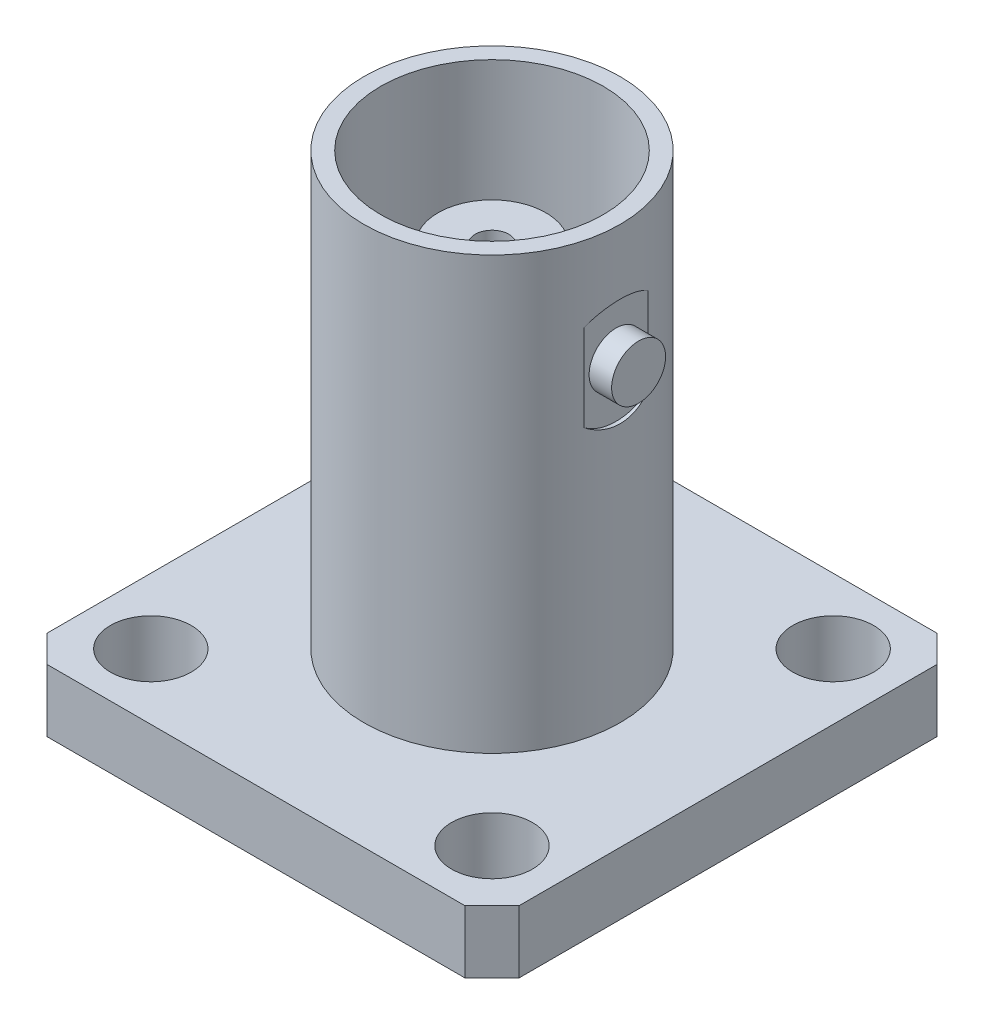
ISO-10303-21;
HEADER;
FILE_DESCRIPTION(('STEP AP214'),'2;1');
FILE_NAME('part.step','',(''),(''),'','','');
FILE_SCHEMA(('AUTOMOTIVE_DESIGN { 1 0 10303 214 1 1 1 1 }'));
ENDSEC;
DATA;
#1=APPLICATION_CONTEXT('core data for automotive mechanical design processes');
#2=APPLICATION_PROTOCOL_DEFINITION('international standard','automotive_design',2000,#1);
#3=PRODUCT_CONTEXT('',#1,'mechanical');
#4=PRODUCT('Part','Part','',(#3));
#5=PRODUCT_RELATED_PRODUCT_CATEGORY('part','',(#4));
#6=PRODUCT_DEFINITION_FORMATION('','',#4);
#7=PRODUCT_DEFINITION_CONTEXT('part definition',#1,'design');
#8=PRODUCT_DEFINITION('design','',#6,#7);
#9=PRODUCT_DEFINITION_SHAPE('','',#8);
#10=(LENGTH_UNIT() NAMED_UNIT(*) SI_UNIT(.MILLI.,.METRE.));
#11=(NAMED_UNIT(*) PLANE_ANGLE_UNIT() SI_UNIT($,.RADIAN.));
#12=(NAMED_UNIT(*) SI_UNIT($,.STERADIAN.) SOLID_ANGLE_UNIT());
#13=UNCERTAINTY_MEASURE_WITH_UNIT(LENGTH_MEASURE(1.E-05),#10,'distance_accuracy_value','');
#14=(GEOMETRIC_REPRESENTATION_CONTEXT(3) GLOBAL_UNCERTAINTY_ASSIGNED_CONTEXT((#13)) GLOBAL_UNIT_ASSIGNED_CONTEXT((#10,
#11,#12)) REPRESENTATION_CONTEXT('',''));
#15=CARTESIAN_POINT('',(0.,0.,0.));
#16=DIRECTION('',(0.,0.,1.));
#17=DIRECTION('',(1.,0.,0.));
#18=AXIS2_PLACEMENT_3D('',#15,#16,#17);
#19=CARTESIAN_POINT('',(0.,18.32,0.));
#20=DIRECTION('',(0.,-1.,0.));
#21=DIRECTION('',(0.,0.,-1.));
#22=AXIS2_PLACEMENT_3D('',#19,#20,#21);
#23=CYLINDRICAL_SURFACE('',#22,4.75);
#24=DIRECTION('',(0.,-1.,0.));
#25=VECTOR('',#24,1.);
#26=CARTESIAN_POINT('',(4.6,18.32,1.1842719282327));
#27=LINE('',#26,#25);
#28=CARTESIAN_POINT('',(4.6,15.5316761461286,1.1842719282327));
#29=VERTEX_POINT('',#28);
#30=CARTESIAN_POINT('',(4.6,12.3083238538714,1.1842719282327));
#31=VERTEX_POINT('',#30);
#32=EDGE_CURVE('E131',#29,#31,#27,.T.);
#33=ORIENTED_EDGE('',*,*,#32,.F.);
#34=CARTESIAN_POINT('',(4.6,15.5316761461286,1.1842719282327));
#35=CARTESIAN_POINT('',(4.61113315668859,15.5634460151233,1.14103185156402));
#36=CARTESIAN_POINT('',(4.621951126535,15.5935051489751,1.09647967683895));
#37=CARTESIAN_POINT('',(4.64271535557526,15.6500290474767,1.00493769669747));
#38=CARTESIAN_POINT('',(4.65266132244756,15.6764926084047,0.957947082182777));
#39=CARTESIAN_POINT('',(4.68084373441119,15.7502675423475,0.813510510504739));
#40=CARTESIAN_POINT('',(4.6973928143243,15.7918750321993,0.712719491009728));
#41=CARTESIAN_POINT('',(4.72427672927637,15.8583555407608,0.504713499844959));
#42=CARTESIAN_POINT('',(4.7345963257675,15.8831875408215,0.397483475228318));
#43=CARTESIAN_POINT('',(4.74782814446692,15.9148894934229,0.180120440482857));
#44=CARTESIAN_POINT('',(4.7507543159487,15.9217932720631,0.0699932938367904));
#45=CARTESIAN_POINT('',(4.74895227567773,15.9175098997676,-0.144815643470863));
#46=CARTESIAN_POINT('',(4.74456563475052,15.9071300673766,-0.249517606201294));
#47=CARTESIAN_POINT('',(4.72922471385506,15.8702172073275,-0.455674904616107));
#48=CARTESIAN_POINT('',(4.71826058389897,15.8436599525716,-0.557125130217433));
#49=CARTESIAN_POINT('',(4.69128557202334,15.776493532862,-0.750717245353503));
#50=CARTESIAN_POINT('',(4.67545424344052,15.7363799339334,-0.843056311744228));
#51=CARTESIAN_POINT('',(4.64893202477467,15.6665757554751,-0.975690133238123));
#52=CARTESIAN_POINT('',(4.63963738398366,15.6417260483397,-1.01888970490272));
#53=CARTESIAN_POINT('',(4.62031799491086,15.5889632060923,-1.10319096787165));
#54=CARTESIAN_POINT('',(4.6102934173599,15.5610507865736,-1.14429314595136));
#55=CARTESIAN_POINT('',(4.6,15.5316761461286,-1.1842719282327));
#56=B_SPLINE_CURVE_WITH_KNOTS('',3,(#34,#35,#36,#37,#38,#39,#40,#41,#42,#43,#44,#45,#46,#47,#48,
#49,#50,#51,#52,#53,#54,#55),.UNSPECIFIED.,.F.,.F.,(4,2,2,2,2,2,2,2,2,2,4),(0.,
0.164310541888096,0.328675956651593,0.657857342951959,0.987840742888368,1.31720109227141,
1.6316043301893,1.94647957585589,2.25090553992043,2.40287289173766,2.55480481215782),.UNSPECIFIED.);
#57=CARTESIAN_POINT('',(4.6,15.5316761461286,-1.1842719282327));
#58=VERTEX_POINT('',#57);
#59=EDGE_CURVE('E189',#29,#58,#56,.T.);
#60=ORIENTED_EDGE('',*,*,#59,.T.);
#61=DIRECTION('',(0.,-1.,0.));
#62=VECTOR('',#61,1.);
#63=CARTESIAN_POINT('',(4.6,18.32,-1.1842719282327));
#64=LINE('',#63,#62);
#65=CARTESIAN_POINT('',(4.6,12.3083238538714,-1.1842719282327));
#66=VERTEX_POINT('',#65);
#67=EDGE_CURVE('E196',#66,#58,#64,.F.);
#68=ORIENTED_EDGE('',*,*,#67,.F.);
#69=CARTESIAN_POINT('',(4.6,12.3083238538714,-1.1842719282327));
#70=CARTESIAN_POINT('',(4.61113315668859,12.2765539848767,-1.14103185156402));
#71=CARTESIAN_POINT('',(4.621951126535,12.2464948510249,-1.09647967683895));
#72=CARTESIAN_POINT('',(4.64271535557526,12.1899709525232,-1.00493769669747));
#73=CARTESIAN_POINT('',(4.65266132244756,12.1635073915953,-0.957947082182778));
#74=CARTESIAN_POINT('',(4.68084373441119,12.0897324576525,-0.81351051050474));
#75=CARTESIAN_POINT('',(4.6973928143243,12.0481249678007,-0.712719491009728));
#76=CARTESIAN_POINT('',(4.72427672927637,11.9816444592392,-0.504713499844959));
#77=CARTESIAN_POINT('',(4.7345963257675,11.9568124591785,-0.397483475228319));
#78=CARTESIAN_POINT('',(4.74782814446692,11.9251105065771,-0.180120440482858));
#79=CARTESIAN_POINT('',(4.7507543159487,11.9182067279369,-0.0699932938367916));
#80=CARTESIAN_POINT('',(4.74895227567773,11.9224901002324,0.144815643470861));
#81=CARTESIAN_POINT('',(4.74456563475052,11.9328699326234,0.249517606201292));
#82=CARTESIAN_POINT('',(4.72922471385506,11.9697827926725,0.455674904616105));
#83=CARTESIAN_POINT('',(4.71826058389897,11.9963400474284,0.557125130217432));
#84=CARTESIAN_POINT('',(4.69128557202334,12.063506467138,0.750717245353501));
#85=CARTESIAN_POINT('',(4.67545424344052,12.1036200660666,0.843056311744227));
#86=CARTESIAN_POINT('',(4.64893202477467,12.1734242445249,0.975690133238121));
#87=CARTESIAN_POINT('',(4.63963738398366,12.1982739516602,1.01888970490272));
#88=CARTESIAN_POINT('',(4.62031799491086,12.2510367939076,1.10319096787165));
#89=CARTESIAN_POINT('',(4.6102934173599,12.2789492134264,1.14429314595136));
#90=CARTESIAN_POINT('',(4.6,12.3083238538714,1.1842719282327));
#91=B_SPLINE_CURVE_WITH_KNOTS('',3,(#69,#70,#71,#72,#73,#74,#75,#76,#77,#78,#79,#80,#81,#82,#83,
#84,#85,#86,#87,#88,#89,#90),.UNSPECIFIED.,.F.,.F.,(4,2,2,2,2,2,2,2,2,2,4),(0.,
0.164310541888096,0.328675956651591,0.657857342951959,0.987840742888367,1.3172010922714,
1.6316043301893,1.94647957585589,2.25090553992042,2.40287289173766,2.55480481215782),.UNSPECIFIED.);
#92=EDGE_CURVE('E54',#66,#31,#91,.T.);
#93=ORIENTED_EDGE('',*,*,#92,.T.);
#94=EDGE_LOOP('',(#33,#60,#68,#93));
#95=FACE_BOUND('',#94,.T.);
#96=CARTESIAN_POINT('',(0.,18.32,0.));
#97=DIRECTION('',(0.,1.,0.));
#98=DIRECTION('',(0.,0.,1.));
#99=AXIS2_PLACEMENT_3D('',#96,#97,#98);
#100=CIRCLE('',#99,4.75);
#101=CARTESIAN_POINT('',(0.,18.32,4.75));
#102=VERTEX_POINT('',#101);
#103=EDGE_CURVE('E298',#102,#102,#100,.T.);
#104=ORIENTED_EDGE('',*,*,#103,.F.);
#105=EDGE_LOOP('',(#104));
#106=FACE_BOUND('',#105,.T.);
#107=CARTESIAN_POINT('',(0.,2.32,0.));
#108=DIRECTION('',(0.,1.,0.));
#109=DIRECTION('',(0.,0.,1.));
#110=AXIS2_PLACEMENT_3D('',#107,#108,#109);
#111=CIRCLE('',#110,4.75);
#112=CARTESIAN_POINT('',(0.,2.32,4.75));
#113=VERTEX_POINT('',#112);
#114=EDGE_CURVE('E301',#113,#113,#111,.T.);
#115=ORIENTED_EDGE('',*,*,#114,.T.);
#116=EDGE_LOOP('',(#115));
#117=FACE_BOUND('',#116,.T.);
#118=CARTESIAN_POINT('',(-4.6,12.3083238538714,-1.1842719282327));
#119=CARTESIAN_POINT('',(-4.61113315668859,12.2765539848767,-1.14103185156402));
#120=CARTESIAN_POINT('',(-4.621951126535,12.2464948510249,-1.09647967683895));
#121=CARTESIAN_POINT('',(-4.64271535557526,12.1899709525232,-1.00493769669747));
#122=CARTESIAN_POINT('',(-4.65266132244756,12.1635073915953,-0.957947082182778));
#123=CARTESIAN_POINT('',(-4.68084373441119,12.0897324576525,-0.81351051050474));
#124=CARTESIAN_POINT('',(-4.6973928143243,12.0481249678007,-0.712719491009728));
#125=CARTESIAN_POINT('',(-4.72427672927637,11.9816444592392,-0.504713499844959));
#126=CARTESIAN_POINT('',(-4.7345963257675,11.9568124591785,-0.397483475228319));
#127=CARTESIAN_POINT('',(-4.74782814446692,11.9251105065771,-0.180120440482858));
#128=CARTESIAN_POINT('',(-4.7507543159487,11.9182067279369,-0.0699932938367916));
#129=CARTESIAN_POINT('',(-4.74895227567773,11.9224901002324,0.144815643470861));
#130=CARTESIAN_POINT('',(-4.74456563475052,11.9328699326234,0.249517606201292));
#131=CARTESIAN_POINT('',(-4.72922471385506,11.9697827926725,0.455674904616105));
#132=CARTESIAN_POINT('',(-4.71826058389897,11.9963400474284,0.557125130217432));
#133=CARTESIAN_POINT('',(-4.69128557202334,12.063506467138,0.750717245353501));
#134=CARTESIAN_POINT('',(-4.67545424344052,12.1036200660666,0.843056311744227));
#135=CARTESIAN_POINT('',(-4.64893202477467,12.1734242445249,0.975690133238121));
#136=CARTESIAN_POINT('',(-4.63963738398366,12.1982739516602,1.01888970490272));
#137=CARTESIAN_POINT('',(-4.62031799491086,12.2510367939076,1.10319096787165));
#138=CARTESIAN_POINT('',(-4.6102934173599,12.2789492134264,1.14429314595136));
#139=CARTESIAN_POINT('',(-4.6,12.3083238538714,1.1842719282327));
#140=B_SPLINE_CURVE_WITH_KNOTS('',3,(#118,#119,#120,#121,#122,#123,#124,#125,#126,#127,#128,
#129,#130,#131,#132,#133,#134,#135,#136,#137,#138,#139),.UNSPECIFIED.,.F.,.F.,(4,2,2,2,2,2,2,2,
2,2,4),(0.,0.164310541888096,0.328675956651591,0.657857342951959,0.987840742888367,
1.3172010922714,1.6316043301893,1.94647957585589,2.25090553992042,2.40287289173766,
2.55480481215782),.UNSPECIFIED.);
#141=CARTESIAN_POINT('',(-4.6,12.3083238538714,-1.1842719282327));
#142=VERTEX_POINT('',#141);
#143=CARTESIAN_POINT('',(-4.6,12.3083238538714,1.1842719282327));
#144=VERTEX_POINT('',#143);
#145=EDGE_CURVE('E130',#142,#144,#140,.T.);
#146=ORIENTED_EDGE('',*,*,#145,.F.);
#147=DIRECTION('',(0.,-1.,0.));
#148=VECTOR('',#147,1.);
#149=CARTESIAN_POINT('',(-4.6,18.32,-1.1842719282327));
#150=LINE('',#149,#148);
#151=CARTESIAN_POINT('',(-4.6,15.5316761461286,-1.1842719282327));
#152=VERTEX_POINT('',#151);
#153=EDGE_CURVE('E40',#152,#142,#150,.T.);
#154=ORIENTED_EDGE('',*,*,#153,.F.);
#155=CARTESIAN_POINT('',(-4.6,15.5316761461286,1.1842719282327));
#156=CARTESIAN_POINT('',(-4.61113315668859,15.5634460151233,1.14103185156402));
#157=CARTESIAN_POINT('',(-4.621951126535,15.5935051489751,1.09647967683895));
#158=CARTESIAN_POINT('',(-4.64271535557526,15.6500290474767,1.00493769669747));
#159=CARTESIAN_POINT('',(-4.65266132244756,15.6764926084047,0.957947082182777));
#160=CARTESIAN_POINT('',(-4.68084373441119,15.7502675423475,0.813510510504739));
#161=CARTESIAN_POINT('',(-4.6973928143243,15.7918750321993,0.712719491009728));
#162=CARTESIAN_POINT('',(-4.72427672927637,15.8583555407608,0.504713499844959));
#163=CARTESIAN_POINT('',(-4.7345963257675,15.8831875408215,0.397483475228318));
#164=CARTESIAN_POINT('',(-4.74782814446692,15.9148894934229,0.180120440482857));
#165=CARTESIAN_POINT('',(-4.7507543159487,15.9217932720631,0.0699932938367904));
#166=CARTESIAN_POINT('',(-4.74895227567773,15.9175098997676,-0.144815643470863));
#167=CARTESIAN_POINT('',(-4.74456563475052,15.9071300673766,-0.249517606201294));
#168=CARTESIAN_POINT('',(-4.72922471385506,15.8702172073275,-0.455674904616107));
#169=CARTESIAN_POINT('',(-4.71826058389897,15.8436599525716,-0.557125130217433));
#170=CARTESIAN_POINT('',(-4.69128557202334,15.776493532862,-0.750717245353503));
#171=CARTESIAN_POINT('',(-4.67545424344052,15.7363799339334,-0.843056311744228));
#172=CARTESIAN_POINT('',(-4.64893202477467,15.6665757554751,-0.975690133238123));
#173=CARTESIAN_POINT('',(-4.63963738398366,15.6417260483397,-1.01888970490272));
#174=CARTESIAN_POINT('',(-4.62031799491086,15.5889632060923,-1.10319096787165));
#175=CARTESIAN_POINT('',(-4.6102934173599,15.5610507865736,-1.14429314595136));
#176=CARTESIAN_POINT('',(-4.6,15.5316761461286,-1.1842719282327));
#177=B_SPLINE_CURVE_WITH_KNOTS('',3,(#155,#156,#157,#158,#159,#160,#161,#162,#163,#164,#165,
#166,#167,#168,#169,#170,#171,#172,#173,#174,#175,#176),.UNSPECIFIED.,.F.,.F.,(4,2,2,2,2,2,2,2,
2,2,4),(0.,0.164310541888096,0.328675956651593,0.657857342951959,0.987840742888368,
1.31720109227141,1.6316043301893,1.94647957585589,2.25090553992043,2.40287289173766,
2.55480481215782),.UNSPECIFIED.);
#178=CARTESIAN_POINT('',(-4.6,15.5316761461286,1.1842719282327));
#179=VERTEX_POINT('',#178);
#180=EDGE_CURVE('E123',#179,#152,#177,.T.);
#181=ORIENTED_EDGE('',*,*,#180,.F.);
#182=DIRECTION('',(0.,-1.,0.));
#183=VECTOR('',#182,1.);
#184=CARTESIAN_POINT('',(-4.6,18.32,1.1842719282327));
#185=LINE('',#184,#183);
#186=EDGE_CURVE('E134',#144,#179,#185,.F.);
#187=ORIENTED_EDGE('',*,*,#186,.F.);
#188=EDGE_LOOP('',(#146,#154,#181,#187));
#189=FACE_BOUND('',#188,.T.);
#190=ADVANCED_FACE('F32',(#95,#106,#117,#189),#23,.T.);
#191=CARTESIAN_POINT('',(8.75,2.32,-8.75));
#192=DIRECTION('',(-1.,0.,0.));
#193=DIRECTION('',(0.,0.,1.));
#194=AXIS2_PLACEMENT_3D('',#191,#192,#193);
#195=PLANE('',#194);
#196=DIRECTION('',(0.,0.,-1.));
#197=VECTOR('',#196,1.);
#198=CARTESIAN_POINT('',(8.75,0.,-8.75));
#199=LINE('',#198,#197);
#200=CARTESIAN_POINT('',(8.75,0.,7.74999999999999));
#201=VERTEX_POINT('',#200);
#202=CARTESIAN_POINT('',(8.75,0.,-7.75));
#203=VERTEX_POINT('',#202);
#204=EDGE_CURVE('E263',#201,#203,#199,.T.);
#205=ORIENTED_EDGE('',*,*,#204,.T.);
#206=DIRECTION('',(0.,1.,0.));
#207=VECTOR('',#206,1.);
#208=CARTESIAN_POINT('',(8.75,2.32,-7.75));
#209=LINE('',#208,#207);
#210=CARTESIAN_POINT('',(8.75,2.32,-7.75));
#211=VERTEX_POINT('',#210);
#212=EDGE_CURVE('E221',#203,#211,#209,.T.);
#213=ORIENTED_EDGE('',*,*,#212,.T.);
#214=DIRECTION('',(0.,0.,-1.));
#215=VECTOR('',#214,1.);
#216=CARTESIAN_POINT('',(8.75,2.32,-8.75));
#217=LINE('',#216,#215);
#218=CARTESIAN_POINT('',(8.75,2.32,7.74999999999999));
#219=VERTEX_POINT('',#218);
#220=EDGE_CURVE('E256',#219,#211,#217,.T.);
#221=ORIENTED_EDGE('',*,*,#220,.F.);
#222=DIRECTION('',(0.,-1.,0.));
#223=VECTOR('',#222,1.);
#224=CARTESIAN_POINT('',(8.75,2.32,7.74999999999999));
#225=LINE('',#224,#223);
#226=EDGE_CURVE('E223',#219,#201,#225,.T.);
#227=ORIENTED_EDGE('',*,*,#226,.T.);
#228=EDGE_LOOP('',(#205,#213,#221,#227));
#229=FACE_BOUND('',#228,.T.);
#230=ADVANCED_FACE('F348',(#229),#195,.F.);
#231=CARTESIAN_POINT('',(-8.75,2.32,-8.75));
#232=DIRECTION('',(0.,0.,1.));
#233=DIRECTION('',(1.,0.,0.));
#234=AXIS2_PLACEMENT_3D('',#231,#232,#233);
#235=PLANE('',#234);
#236=DIRECTION('',(-1.,0.,0.));
#237=VECTOR('',#236,1.);
#238=CARTESIAN_POINT('',(-8.75,0.,-8.75));
#239=LINE('',#238,#237);
#240=CARTESIAN_POINT('',(7.75000000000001,0.,-8.75));
#241=VERTEX_POINT('',#240);
#242=CARTESIAN_POINT('',(-7.75,0.,-8.75));
#243=VERTEX_POINT('',#242);
#244=EDGE_CURVE('E260',#241,#243,#239,.T.);
#245=ORIENTED_EDGE('',*,*,#244,.T.);
#246=DIRECTION('',(0.,1.,0.));
#247=VECTOR('',#246,1.);
#248=CARTESIAN_POINT('',(-7.75,2.32,-8.75));
#249=LINE('',#248,#247);
#250=CARTESIAN_POINT('',(-7.75,2.32,-8.75));
#251=VERTEX_POINT('',#250);
#252=EDGE_CURVE('E234',#243,#251,#249,.T.);
#253=ORIENTED_EDGE('',*,*,#252,.T.);
#254=DIRECTION('',(-1.,0.,0.));
#255=VECTOR('',#254,1.);
#256=CARTESIAN_POINT('',(-8.75,2.32,-8.75));
#257=LINE('',#256,#255);
#258=CARTESIAN_POINT('',(7.75000000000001,2.32,-8.75));
#259=VERTEX_POINT('',#258);
#260=EDGE_CURVE('E272',#259,#251,#257,.T.);
#261=ORIENTED_EDGE('',*,*,#260,.F.);
#262=DIRECTION('',(0.,-1.,0.));
#263=VECTOR('',#262,1.);
#264=CARTESIAN_POINT('',(7.75000000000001,2.32,-8.75));
#265=LINE('',#264,#263);
#266=EDGE_CURVE('E236',#259,#241,#265,.T.);
#267=ORIENTED_EDGE('',*,*,#266,.T.);
#268=EDGE_LOOP('',(#245,#253,#261,#267));
#269=FACE_BOUND('',#268,.T.);
#270=ADVANCED_FACE('F352',(#269),#235,.F.);
#271=CARTESIAN_POINT('',(-8.75,2.32,-8.75));
#272=DIRECTION('',(1.,0.,0.));
#273=DIRECTION('',(0.,0.,-1.));
#274=AXIS2_PLACEMENT_3D('',#271,#272,#273);
#275=PLANE('',#274);
#276=DIRECTION('',(0.,0.,1.));
#277=VECTOR('',#276,1.);
#278=CARTESIAN_POINT('',(-8.75,2.32,-8.75));
#279=LINE('',#278,#277);
#280=CARTESIAN_POINT('',(-8.75,2.32,-7.75000000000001));
#281=VERTEX_POINT('',#280);
#282=CARTESIAN_POINT('',(-8.75,2.32,7.75));
#283=VERTEX_POINT('',#282);
#284=EDGE_CURVE('E269',#281,#283,#279,.T.);
#285=ORIENTED_EDGE('',*,*,#284,.F.);
#286=DIRECTION('',(0.,-1.,0.));
#287=VECTOR('',#286,1.);
#288=CARTESIAN_POINT('',(-8.75,2.32,-7.75000000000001));
#289=LINE('',#288,#287);
#290=CARTESIAN_POINT('',(-8.75,0.,-7.75000000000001));
#291=VERTEX_POINT('',#290);
#292=EDGE_CURVE('E247',#281,#291,#289,.T.);
#293=ORIENTED_EDGE('',*,*,#292,.T.);
#294=DIRECTION('',(0.,0.,1.));
#295=VECTOR('',#294,1.);
#296=CARTESIAN_POINT('',(-8.75,0.,-8.75));
#297=LINE('',#296,#295);
#298=CARTESIAN_POINT('',(-8.75,0.,7.75));
#299=VERTEX_POINT('',#298);
#300=EDGE_CURVE('E257',#291,#299,#297,.T.);
#301=ORIENTED_EDGE('',*,*,#300,.T.);
#302=DIRECTION('',(0.,1.,0.));
#303=VECTOR('',#302,1.);
#304=CARTESIAN_POINT('',(-8.75,2.32,7.75));
#305=LINE('',#304,#303);
#306=EDGE_CURVE('E250',#299,#283,#305,.T.);
#307=ORIENTED_EDGE('',*,*,#306,.T.);
#308=EDGE_LOOP('',(#285,#293,#301,#307));
#309=FACE_BOUND('',#308,.T.);
#310=ADVANCED_FACE('F358',(#309),#275,.F.);
#311=CARTESIAN_POINT('',(-8.75,2.32,8.75));
#312=DIRECTION('',(0.,0.,-1.));
#313=DIRECTION('',(-1.,0.,0.));
#314=AXIS2_PLACEMENT_3D('',#311,#312,#313);
#315=PLANE('',#314);
#316=DIRECTION('',(1.,0.,0.));
#317=VECTOR('',#316,1.);
#318=CARTESIAN_POINT('',(-8.75,0.,8.75));
#319=LINE('',#318,#317);
#320=CARTESIAN_POINT('',(-7.75000000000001,0.,8.75));
#321=VERTEX_POINT('',#320);
#322=CARTESIAN_POINT('',(7.75,0.,8.75));
#323=VERTEX_POINT('',#322);
#324=EDGE_CURVE('E253',#321,#323,#319,.T.);
#325=ORIENTED_EDGE('',*,*,#324,.T.);
#326=DIRECTION('',(0.,1.,0.));
#327=VECTOR('',#326,1.);
#328=CARTESIAN_POINT('',(7.75,2.32,8.75));
#329=LINE('',#328,#327);
#330=CARTESIAN_POINT('',(7.75,2.32,8.75));
#331=VERTEX_POINT('',#330);
#332=EDGE_CURVE('E214',#323,#331,#329,.T.);
#333=ORIENTED_EDGE('',*,*,#332,.T.);
#334=DIRECTION('',(1.,0.,0.));
#335=VECTOR('',#334,1.);
#336=CARTESIAN_POINT('',(-8.75,2.32,8.75));
#337=LINE('',#336,#335);
#338=CARTESIAN_POINT('',(-7.75000000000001,2.32,8.75));
#339=VERTEX_POINT('',#338);
#340=EDGE_CURVE('E252',#339,#331,#337,.T.);
#341=ORIENTED_EDGE('',*,*,#340,.F.);
#342=DIRECTION('',(0.,-1.,0.));
#343=VECTOR('',#342,1.);
#344=CARTESIAN_POINT('',(-7.75000000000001,2.32,8.75));
#345=LINE('',#344,#343);
#346=EDGE_CURVE('E218',#339,#321,#345,.T.);
#347=ORIENTED_EDGE('',*,*,#346,.T.);
#348=EDGE_LOOP('',(#325,#333,#341,#347));
#349=FACE_BOUND('',#348,.T.);
#350=ADVANCED_FACE('F402',(#349),#315,.F.);
#351=CARTESIAN_POINT('',(0.,2.32,0.));
#352=DIRECTION('',(0.,1.,0.));
#353=DIRECTION('',(0.,0.,1.));
#354=AXIS2_PLACEMENT_3D('',#351,#352,#353);
#355=PLANE('',#354);
#356=ORIENTED_EDGE('',*,*,#114,.F.);
#357=EDGE_LOOP('',(#356));
#358=FACE_BOUND('',#357,.T.);
#359=CARTESIAN_POINT('',(-6.325,2.32,6.325));
#360=DIRECTION('',(0.,1.,0.));
#361=DIRECTION('',(0.,0.,-1.));
#362=AXIS2_PLACEMENT_3D('',#359,#360,#361);
#363=CIRCLE('',#362,1.5);
#364=CARTESIAN_POINT('',(-6.325,2.32,4.825));
#365=VERTEX_POINT('',#364);
#366=EDGE_CURVE('E295',#365,#365,#363,.T.);
#367=ORIENTED_EDGE('',*,*,#366,.F.);
#368=EDGE_LOOP('',(#367));
#369=FACE_BOUND('',#368,.T.);
#370=CARTESIAN_POINT('',(-6.325,2.32,-6.325));
#371=DIRECTION('',(0.,-1.,0.));
#372=DIRECTION('',(0.,0.,1.));
#373=AXIS2_PLACEMENT_3D('',#370,#371,#372);
#374=CIRCLE('',#373,1.5);
#375=CARTESIAN_POINT('',(-6.325,2.32,-4.825));
#376=VERTEX_POINT('',#375);
#377=EDGE_CURVE('E289',#376,#376,#374,.T.);
#378=ORIENTED_EDGE('',*,*,#377,.T.);
#379=EDGE_LOOP('',(#378));
#380=FACE_BOUND('',#379,.T.);
#381=CARTESIAN_POINT('',(6.325,2.32,6.325));
#382=DIRECTION('',(0.,-1.,0.));
#383=DIRECTION('',(0.,0.,-1.));
#384=AXIS2_PLACEMENT_3D('',#381,#382,#383);
#385=CIRCLE('',#384,1.5);
#386=CARTESIAN_POINT('',(6.325,2.32,4.825));
#387=VERTEX_POINT('',#386);
#388=EDGE_CURVE('E283',#387,#387,#385,.T.);
#389=ORIENTED_EDGE('',*,*,#388,.T.);
#390=EDGE_LOOP('',(#389));
#391=FACE_BOUND('',#390,.T.);
#392=CARTESIAN_POINT('',(6.325,2.32,-6.325));
#393=DIRECTION('',(0.,1.,0.));
#394=DIRECTION('',(0.,0.,1.));
#395=AXIS2_PLACEMENT_3D('',#392,#393,#394);
#396=CIRCLE('',#395,1.5);
#397=CARTESIAN_POINT('',(6.325,2.32,-4.825));
#398=VERTEX_POINT('',#397);
#399=EDGE_CURVE('E277',#398,#398,#396,.T.);
#400=ORIENTED_EDGE('',*,*,#399,.F.);
#401=EDGE_LOOP('',(#400));
#402=FACE_BOUND('',#401,.T.);
#403=ORIENTED_EDGE('',*,*,#260,.T.);
#404=DIRECTION('',(0.707106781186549,0.,-0.707106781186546));
#405=VECTOR('',#404,1.);
#406=CARTESIAN_POINT('',(-8.24999999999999,2.32,-8.25000000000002));
#407=LINE('',#406,#405);
#408=EDGE_CURVE('E226',#251,#281,#407,.F.);
#409=ORIENTED_EDGE('',*,*,#408,.T.);
#410=ORIENTED_EDGE('',*,*,#284,.T.);
#411=DIRECTION('',(-0.707106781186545,0.,-0.70710678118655));
#412=VECTOR('',#411,1.);
#413=CARTESIAN_POINT('',(-8.25000000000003,2.32,8.24999999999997));
#414=LINE('',#413,#412);
#415=EDGE_CURVE('E232',#283,#339,#414,.F.);
#416=ORIENTED_EDGE('',*,*,#415,.T.);
#417=ORIENTED_EDGE('',*,*,#340,.T.);
#418=DIRECTION('',(-0.707106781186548,0.,0.707106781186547));
#419=VECTOR('',#418,1.);
#420=CARTESIAN_POINT('',(8.24999999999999,2.32,8.25000000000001));
#421=LINE('',#420,#419);
#422=EDGE_CURVE('E230',#331,#219,#421,.F.);
#423=ORIENTED_EDGE('',*,*,#422,.T.);
#424=ORIENTED_EDGE('',*,*,#220,.T.);
#425=DIRECTION('',(0.707106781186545,0.,0.70710678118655));
#426=VECTOR('',#425,1.);
#427=CARTESIAN_POINT('',(8.25000000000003,2.32,-8.24999999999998));
#428=LINE('',#427,#426);
#429=EDGE_CURVE('E228',#211,#259,#428,.F.);
#430=ORIENTED_EDGE('',*,*,#429,.T.);
#431=EDGE_LOOP('',(#403,#409,#410,#416,#417,#423,#424,#430));
#432=FACE_BOUND('',#431,.T.);
#433=ADVANCED_FACE('F384',(#358,#369,#380,#391,#402,#432),#355,.T.);
#434=CARTESIAN_POINT('',(0.,0.,0.));
#435=DIRECTION('',(0.,1.,0.));
#436=DIRECTION('',(0.,0.,1.));
#437=AXIS2_PLACEMENT_3D('',#434,#435,#436);
#438=PLANE('',#437);
#439=CARTESIAN_POINT('',(0.,0.,0.));
#440=DIRECTION('',(0.,1.,0.));
#441=DIRECTION('',(0.,0.,1.));
#442=AXIS2_PLACEMENT_3D('',#439,#440,#441);
#443=CIRCLE('',#442,4.35);
#444=CARTESIAN_POINT('',(0.,0.,4.35));
#445=VERTEX_POINT('',#444);
#446=EDGE_CURVE('E208',#445,#445,#443,.F.);
#447=ORIENTED_EDGE('',*,*,#446,.F.);
#448=EDGE_LOOP('',(#447));
#449=FACE_BOUND('',#448,.T.);
#450=CARTESIAN_POINT('',(-6.325,0.,6.325));
#451=DIRECTION('',(0.,1.,0.));
#452=DIRECTION('',(0.,0.,-1.));
#453=AXIS2_PLACEMENT_3D('',#450,#451,#452);
#454=CIRCLE('',#453,1.5);
#455=CARTESIAN_POINT('',(-6.325,0.,4.825));
#456=VERTEX_POINT('',#455);
#457=EDGE_CURVE('E292',#456,#456,#454,.T.);
#458=ORIENTED_EDGE('',*,*,#457,.T.);
#459=EDGE_LOOP('',(#458));
#460=FACE_BOUND('',#459,.T.);
#461=CARTESIAN_POINT('',(-6.325,0.,-6.325));
#462=DIRECTION('',(0.,-1.,0.));
#463=DIRECTION('',(0.,0.,1.));
#464=AXIS2_PLACEMENT_3D('',#461,#462,#463);
#465=CIRCLE('',#464,1.5);
#466=CARTESIAN_POINT('',(-6.325,0.,-4.825));
#467=VERTEX_POINT('',#466);
#468=EDGE_CURVE('E286',#467,#467,#465,.T.);
#469=ORIENTED_EDGE('',*,*,#468,.F.);
#470=EDGE_LOOP('',(#469));
#471=FACE_BOUND('',#470,.T.);
#472=CARTESIAN_POINT('',(6.325,0.,6.325));
#473=DIRECTION('',(0.,-1.,0.));
#474=DIRECTION('',(0.,0.,-1.));
#475=AXIS2_PLACEMENT_3D('',#472,#473,#474);
#476=CIRCLE('',#475,1.5);
#477=CARTESIAN_POINT('',(6.325,0.,4.825));
#478=VERTEX_POINT('',#477);
#479=EDGE_CURVE('E280',#478,#478,#476,.T.);
#480=ORIENTED_EDGE('',*,*,#479,.F.);
#481=EDGE_LOOP('',(#480));
#482=FACE_BOUND('',#481,.T.);
#483=CARTESIAN_POINT('',(6.325,0.,-6.325));
#484=DIRECTION('',(0.,1.,0.));
#485=DIRECTION('',(0.,0.,1.));
#486=AXIS2_PLACEMENT_3D('',#483,#484,#485);
#487=CIRCLE('',#486,1.5);
#488=CARTESIAN_POINT('',(6.325,0.,-4.825));
#489=VERTEX_POINT('',#488);
#490=EDGE_CURVE('E266',#489,#489,#487,.T.);
#491=ORIENTED_EDGE('',*,*,#490,.T.);
#492=EDGE_LOOP('',(#491));
#493=FACE_BOUND('',#492,.T.);
#494=ORIENTED_EDGE('',*,*,#300,.F.);
#495=DIRECTION('',(-0.707106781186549,0.,0.707106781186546));
#496=VECTOR('',#495,1.);
#497=CARTESIAN_POINT('',(-8.75,0.,-7.75000000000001));
#498=LINE('',#497,#496);
#499=EDGE_CURVE('E239',#291,#243,#498,.F.);
#500=ORIENTED_EDGE('',*,*,#499,.T.);
#501=ORIENTED_EDGE('',*,*,#244,.F.);
#502=DIRECTION('',(-0.707106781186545,0.,-0.70710678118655));
#503=VECTOR('',#502,1.);
#504=CARTESIAN_POINT('',(7.75000000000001,0.,-8.75));
#505=LINE('',#504,#503);
#506=EDGE_CURVE('E241',#241,#203,#505,.F.);
#507=ORIENTED_EDGE('',*,*,#506,.T.);
#508=ORIENTED_EDGE('',*,*,#204,.F.);
#509=DIRECTION('',(0.707106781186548,0.,-0.707106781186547));
#510=VECTOR('',#509,1.);
#511=CARTESIAN_POINT('',(8.75,0.,7.74999999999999));
#512=LINE('',#511,#510);
#513=EDGE_CURVE('E243',#201,#323,#512,.F.);
#514=ORIENTED_EDGE('',*,*,#513,.T.);
#515=ORIENTED_EDGE('',*,*,#324,.F.);
#516=DIRECTION('',(0.707106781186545,0.,0.70710678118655));
#517=VECTOR('',#516,1.);
#518=CARTESIAN_POINT('',(-7.75000000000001,0.,8.75));
#519=LINE('',#518,#517);
#520=EDGE_CURVE('E245',#321,#299,#519,.F.);
#521=ORIENTED_EDGE('',*,*,#520,.T.);
#522=EDGE_LOOP('',(#494,#500,#501,#507,#508,#514,#515,#521));
#523=FACE_BOUND('',#522,.T.);
#524=ADVANCED_FACE('F367',(#449,#460,#471,#482,#493,#523),#438,.F.);
#525=CARTESIAN_POINT('',(-8.75,2.32,-7.75000000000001));
#526=DIRECTION('',(0.707106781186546,0.,0.707106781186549));
#527=DIRECTION('',(0.,-1.,0.));
#528=AXIS2_PLACEMENT_3D('',#525,#526,#527);
#529=PLANE('',#528);
#530=ORIENTED_EDGE('',*,*,#408,.F.);
#531=ORIENTED_EDGE('',*,*,#252,.F.);
#532=ORIENTED_EDGE('',*,*,#499,.F.);
#533=ORIENTED_EDGE('',*,*,#292,.F.);
#534=EDGE_LOOP('',(#530,#531,#532,#533));
#535=FACE_BOUND('',#534,.T.);
#536=ADVANCED_FACE('F363',(#535),#529,.F.);
#537=CARTESIAN_POINT('',(7.75000000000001,2.32,-8.75));
#538=DIRECTION('',(-0.70710678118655,0.,0.707106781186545));
#539=DIRECTION('',(0.,-1.,0.));
#540=AXIS2_PLACEMENT_3D('',#537,#538,#539);
#541=PLANE('',#540);
#542=ORIENTED_EDGE('',*,*,#429,.F.);
#543=ORIENTED_EDGE('',*,*,#212,.F.);
#544=ORIENTED_EDGE('',*,*,#506,.F.);
#545=ORIENTED_EDGE('',*,*,#266,.F.);
#546=EDGE_LOOP('',(#542,#543,#544,#545));
#547=FACE_BOUND('',#546,.T.);
#548=ADVANCED_FACE('F366',(#547),#541,.F.);
#549=CARTESIAN_POINT('',(8.75,2.32,7.74999999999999));
#550=DIRECTION('',(-0.707106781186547,0.,-0.707106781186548));
#551=DIRECTION('',(0.,-1.,0.));
#552=AXIS2_PLACEMENT_3D('',#549,#550,#551);
#553=PLANE('',#552);
#554=ORIENTED_EDGE('',*,*,#422,.F.);
#555=ORIENTED_EDGE('',*,*,#332,.F.);
#556=ORIENTED_EDGE('',*,*,#513,.F.);
#557=ORIENTED_EDGE('',*,*,#226,.F.);
#558=EDGE_LOOP('',(#554,#555,#556,#557));
#559=FACE_BOUND('',#558,.T.);
#560=ADVANCED_FACE('F370',(#559),#553,.F.);
#561=CARTESIAN_POINT('',(-7.75000000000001,2.32,8.75));
#562=DIRECTION('',(0.70710678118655,0.,-0.707106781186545));
#563=DIRECTION('',(0.,-1.,0.));
#564=AXIS2_PLACEMENT_3D('',#561,#562,#563);
#565=PLANE('',#564);
#566=ORIENTED_EDGE('',*,*,#415,.F.);
#567=ORIENTED_EDGE('',*,*,#306,.F.);
#568=ORIENTED_EDGE('',*,*,#520,.F.);
#569=ORIENTED_EDGE('',*,*,#346,.F.);
#570=EDGE_LOOP('',(#566,#567,#568,#569));
#571=FACE_BOUND('',#570,.T.);
#572=ADVANCED_FACE('F34',(#571),#565,.F.);
#573=CARTESIAN_POINT('',(6.325,0.,-6.325));
#574=DIRECTION('',(0.,1.,0.));
#575=DIRECTION('',(0.,0.,1.));
#576=AXIS2_PLACEMENT_3D('',#573,#574,#575);
#577=CYLINDRICAL_SURFACE('',#576,1.5);
#578=ORIENTED_EDGE('',*,*,#490,.F.);
#579=EDGE_LOOP('',(#578));
#580=FACE_BOUND('',#579,.T.);
#581=ORIENTED_EDGE('',*,*,#399,.T.);
#582=EDGE_LOOP('',(#581));
#583=FACE_BOUND('',#582,.T.);
#584=ADVANCED_FACE('F377',(#580,#583),#577,.F.);
#585=CARTESIAN_POINT('',(6.325,0.,6.325));
#586=DIRECTION('',(0.,1.,0.));
#587=DIRECTION('',(0.,0.,1.));
#588=AXIS2_PLACEMENT_3D('',#585,#586,#587);
#589=CYLINDRICAL_SURFACE('',#588,1.5);
#590=ORIENTED_EDGE('',*,*,#479,.T.);
#591=EDGE_LOOP('',(#590));
#592=FACE_BOUND('',#591,.T.);
#593=ORIENTED_EDGE('',*,*,#388,.F.);
#594=EDGE_LOOP('',(#593));
#595=FACE_BOUND('',#594,.T.);
#596=ADVANCED_FACE('F650',(#592,#595),#589,.F.);
#597=CARTESIAN_POINT('',(-6.325,0.,-6.325));
#598=DIRECTION('',(0.,1.,0.));
#599=DIRECTION('',(0.,0.,1.));
#600=AXIS2_PLACEMENT_3D('',#597,#598,#599);
#601=CYLINDRICAL_SURFACE('',#600,1.5);
#602=ORIENTED_EDGE('',*,*,#468,.T.);
#603=EDGE_LOOP('',(#602));
#604=FACE_BOUND('',#603,.T.);
#605=ORIENTED_EDGE('',*,*,#377,.F.);
#606=EDGE_LOOP('',(#605));
#607=FACE_BOUND('',#606,.T.);
#608=ADVANCED_FACE('F658',(#604,#607),#601,.F.);
#609=CARTESIAN_POINT('',(-6.325,0.,6.325));
#610=DIRECTION('',(0.,1.,0.));
#611=DIRECTION('',(0.,0.,1.));
#612=AXIS2_PLACEMENT_3D('',#609,#610,#611);
#613=CYLINDRICAL_SURFACE('',#612,1.5);
#614=ORIENTED_EDGE('',*,*,#457,.F.);
#615=EDGE_LOOP('',(#614));
#616=FACE_BOUND('',#615,.T.);
#617=ORIENTED_EDGE('',*,*,#366,.T.);
#618=EDGE_LOOP('',(#617));
#619=FACE_BOUND('',#618,.T.);
#620=ADVANCED_FACE('F438',(#616,#619),#613,.F.);
#621=CARTESIAN_POINT('',(0.,18.32,0.));
#622=DIRECTION('',(0.,1.,0.));
#623=DIRECTION('',(0.,0.,1.));
#624=AXIS2_PLACEMENT_3D('',#621,#622,#623);
#625=PLANE('',#624);
#626=ORIENTED_EDGE('',*,*,#103,.T.);
#627=EDGE_LOOP('',(#626));
#628=FACE_BOUND('',#627,.T.);
#629=CARTESIAN_POINT('',(0.,18.32,0.));
#630=DIRECTION('',(0.,1.,0.));
#631=DIRECTION('',(0.,0.,1.));
#632=AXIS2_PLACEMENT_3D('',#629,#630,#631);
#633=CIRCLE('',#632,4.125);
#634=CARTESIAN_POINT('',(0.,18.32,4.125));
#635=VERTEX_POINT('',#634);
#636=EDGE_CURVE('E304',#635,#635,#633,.T.);
#637=ORIENTED_EDGE('',*,*,#636,.F.);
#638=EDGE_LOOP('',(#637));
#639=FACE_BOUND('',#638,.T.);
#640=ADVANCED_FACE('F443',(#628,#639),#625,.T.);
#641=CARTESIAN_POINT('',(0.,18.32,0.));
#642=DIRECTION('',(0.,-1.,0.));
#643=DIRECTION('',(0.,0.,-1.));
#644=AXIS2_PLACEMENT_3D('',#641,#642,#643);
#645=CYLINDRICAL_SURFACE('',#644,4.125);
#646=CARTESIAN_POINT('',(0.,9.87,0.));
#647=DIRECTION('',(0.,1.,0.));
#648=DIRECTION('',(0.,0.,1.));
#649=AXIS2_PLACEMENT_3D('',#646,#647,#648);
#650=CIRCLE('',#649,4.125);
#651=CARTESIAN_POINT('',(0.,9.87,4.125));
#652=VERTEX_POINT('',#651);
#653=EDGE_CURVE('E210',#652,#652,#650,.T.);
#654=ORIENTED_EDGE('',*,*,#653,.F.);
#655=EDGE_LOOP('',(#654));
#656=FACE_BOUND('',#655,.T.);
#657=ORIENTED_EDGE('',*,*,#636,.T.);
#658=EDGE_LOOP('',(#657));
#659=FACE_BOUND('',#658,.T.);
#660=ADVANCED_FACE('F448',(#656,#659),#645,.F.);
#661=CARTESIAN_POINT('',(0.,9.87,0.));
#662=DIRECTION('',(0.,1.,0.));
#663=DIRECTION('',(0.,0.,1.));
#664=AXIS2_PLACEMENT_3D('',#661,#662,#663);
#665=PLANE('',#664);
#666=CARTESIAN_POINT('',(0.,9.87,0.));
#667=DIRECTION('',(0.,1.,0.));
#668=DIRECTION('',(0.,0.,1.));
#669=AXIS2_PLACEMENT_3D('',#666,#667,#668);
#670=CIRCLE('',#669,2.);
#671=CARTESIAN_POINT('',(0.,9.87,2.));
#672=VERTEX_POINT('',#671);
#673=EDGE_CURVE('E310',#672,#672,#670,.T.);
#674=ORIENTED_EDGE('',*,*,#673,.F.);
#675=EDGE_LOOP('',(#674));
#676=FACE_BOUND('',#675,.T.);
#677=ORIENTED_EDGE('',*,*,#653,.T.);
#678=EDGE_LOOP('',(#677));
#679=FACE_BOUND('',#678,.T.);
#680=ADVANCED_FACE('F457',(#676,#679),#665,.T.);
#681=CARTESIAN_POINT('',(0.,15.32,0.));
#682=DIRECTION('',(0.,-1.,0.));
#683=DIRECTION('',(0.,0.,-1.));
#684=AXIS2_PLACEMENT_3D('',#681,#682,#683);
#685=CYLINDRICAL_SURFACE('',#684,2.);
#686=CARTESIAN_POINT('',(0.,15.32,0.));
#687=DIRECTION('',(0.,1.,0.));
#688=DIRECTION('',(0.,0.,1.));
#689=AXIS2_PLACEMENT_3D('',#686,#687,#688);
#690=CIRCLE('',#689,2.);
#691=CARTESIAN_POINT('',(0.,15.32,2.));
#692=VERTEX_POINT('',#691);
#693=EDGE_CURVE('E309',#692,#692,#690,.T.);
#694=ORIENTED_EDGE('',*,*,#693,.F.);
#695=EDGE_LOOP('',(#694));
#696=FACE_BOUND('',#695,.T.);
#697=ORIENTED_EDGE('',*,*,#673,.T.);
#698=EDGE_LOOP('',(#697));
#699=FACE_BOUND('',#698,.T.);
#700=ADVANCED_FACE('F467',(#696,#699),#685,.T.);
#701=CARTESIAN_POINT('',(0.,15.32,0.));
#702=DIRECTION('',(0.,1.,0.));
#703=DIRECTION('',(0.,0.,1.));
#704=AXIS2_PLACEMENT_3D('',#701,#702,#703);
#705=PLANE('',#704);
#706=CARTESIAN_POINT('',(0.,15.32,0.));
#707=DIRECTION('',(0.,1.,0.));
#708=DIRECTION('',(0.,0.,1.));
#709=AXIS2_PLACEMENT_3D('',#706,#707,#708);
#710=CIRCLE('',#709,0.622706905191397);
#711=CARTESIAN_POINT('',(0.,15.32,0.622706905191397));
#712=VERTEX_POINT('',#711);
#713=EDGE_CURVE('E325',#712,#712,#710,.T.);
#714=ORIENTED_EDGE('',*,*,#713,.F.);
#715=EDGE_LOOP('',(#714));
#716=FACE_BOUND('',#715,.T.);
#717=ORIENTED_EDGE('',*,*,#693,.T.);
#718=EDGE_LOOP('',(#717));
#719=FACE_BOUND('',#718,.T.);
#720=ADVANCED_FACE('F476',(#716,#719),#705,.T.);
#721=CARTESIAN_POINT('',(0.,-1.4,0.));
#722=DIRECTION('',(0.,1.,0.));
#723=DIRECTION('',(0.,0.,1.));
#724=AXIS2_PLACEMENT_3D('',#721,#722,#723);
#725=CYLINDRICAL_SURFACE('',#724,4.35);
#726=CARTESIAN_POINT('',(0.,-1.4,0.));
#727=DIRECTION('',(0.,-1.,0.));
#728=DIRECTION('',(0.,0.,-1.));
#729=AXIS2_PLACEMENT_3D('',#726,#727,#728);
#730=CIRCLE('',#729,4.35);
#731=CARTESIAN_POINT('',(0.,-1.4,-4.35));
#732=VERTEX_POINT('',#731);
#733=EDGE_CURVE('E313',#732,#732,#730,.T.);
#734=ORIENTED_EDGE('',*,*,#733,.F.);
#735=EDGE_LOOP('',(#734));
#736=FACE_BOUND('',#735,.T.);
#737=ORIENTED_EDGE('',*,*,#446,.T.);
#738=EDGE_LOOP('',(#737));
#739=FACE_BOUND('',#738,.T.);
#740=ADVANCED_FACE('F489',(#736,#739),#725,.T.);
#741=CARTESIAN_POINT('',(0.,-1.4,0.));
#742=DIRECTION('',(0.,-1.,0.));
#743=DIRECTION('',(0.,0.,-1.));
#744=AXIS2_PLACEMENT_3D('',#741,#742,#743);
#745=PLANE('',#744);
#746=CARTESIAN_POINT('',(0.,-1.4,0.));
#747=DIRECTION('',(0.,-1.,0.));
#748=DIRECTION('',(0.,0.,-1.));
#749=AXIS2_PLACEMENT_3D('',#746,#747,#748);
#750=CIRCLE('',#749,2.675);
#751=CARTESIAN_POINT('',(0.,-1.4,-2.675));
#752=VERTEX_POINT('',#751);
#753=EDGE_CURVE('E319',#752,#752,#750,.T.);
#754=ORIENTED_EDGE('',*,*,#753,.F.);
#755=EDGE_LOOP('',(#754));
#756=FACE_BOUND('',#755,.T.);
#757=ORIENTED_EDGE('',*,*,#733,.T.);
#758=EDGE_LOOP('',(#757));
#759=FACE_BOUND('',#758,.T.);
#760=ADVANCED_FACE('F494',(#756,#759),#745,.T.);
#761=CARTESIAN_POINT('',(0.,-2.85,0.));
#762=DIRECTION('',(0.,1.,0.));
#763=DIRECTION('',(0.,0.,1.));
#764=AXIS2_PLACEMENT_3D('',#761,#762,#763);
#765=CYLINDRICAL_SURFACE('',#764,2.675);
#766=CARTESIAN_POINT('',(0.,-2.85,0.));
#767=DIRECTION('',(0.,-1.,0.));
#768=DIRECTION('',(0.,0.,-1.));
#769=AXIS2_PLACEMENT_3D('',#766,#767,#768);
#770=CIRCLE('',#769,2.675);
#771=CARTESIAN_POINT('',(0.,-2.85,-2.675));
#772=VERTEX_POINT('',#771);
#773=EDGE_CURVE('E318',#772,#772,#770,.T.);
#774=ORIENTED_EDGE('',*,*,#773,.F.);
#775=EDGE_LOOP('',(#774));
#776=FACE_BOUND('',#775,.T.);
#777=ORIENTED_EDGE('',*,*,#753,.T.);
#778=EDGE_LOOP('',(#777));
#779=FACE_BOUND('',#778,.T.);
#780=ADVANCED_FACE('F504',(#776,#779),#765,.T.);
#781=CARTESIAN_POINT('',(0.,-2.85,0.));
#782=DIRECTION('',(0.,-1.,0.));
#783=DIRECTION('',(0.,0.,-1.));
#784=AXIS2_PLACEMENT_3D('',#781,#782,#783);
#785=PLANE('',#784);
#786=CARTESIAN_POINT('',(0.,-2.85,0.));
#787=DIRECTION('',(0.,1.,0.));
#788=DIRECTION('',(0.,0.,1.));
#789=AXIS2_PLACEMENT_3D('',#786,#787,#788);
#790=CIRCLE('',#789,0.622706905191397);
#791=CARTESIAN_POINT('',(0.,-2.85,0.622706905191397));
#792=VERTEX_POINT('',#791);
#793=EDGE_CURVE('E322',#792,#792,#790,.T.);
#794=ORIENTED_EDGE('',*,*,#793,.T.);
#795=EDGE_LOOP('',(#794));
#796=FACE_BOUND('',#795,.T.);
#797=ORIENTED_EDGE('',*,*,#773,.T.);
#798=EDGE_LOOP('',(#797));
#799=FACE_BOUND('',#798,.T.);
#800=ADVANCED_FACE('F514',(#796,#799),#785,.T.);
#801=CARTESIAN_POINT('',(0.,-2.85,0.));
#802=DIRECTION('',(0.,1.,0.));
#803=DIRECTION('',(0.,0.,1.));
#804=AXIS2_PLACEMENT_3D('',#801,#802,#803);
#805=CYLINDRICAL_SURFACE('',#804,0.622706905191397);
#806=ORIENTED_EDGE('',*,*,#793,.F.);
#807=EDGE_LOOP('',(#806));
#808=FACE_BOUND('',#807,.T.);
#809=ORIENTED_EDGE('',*,*,#713,.T.);
#810=EDGE_LOOP('',(#809));
#811=FACE_BOUND('',#810,.T.);
#812=ADVANCED_FACE('F178',(#808,#811),#805,.F.);
#813=CARTESIAN_POINT('',(4.6,13.92,0.));
#814=DIRECTION('',(1.,0.,0.));
#815=DIRECTION('',(0.,0.,-1.));
#816=AXIS2_PLACEMENT_3D('',#813,#814,#815);
#817=CYLINDRICAL_SURFACE('',#816,2.);
#818=CARTESIAN_POINT('',(4.6,13.92,0.));
#819=DIRECTION('',(1.,0.,0.));
#820=DIRECTION('',(0.,0.,-1.));
#821=AXIS2_PLACEMENT_3D('',#818,#819,#820);
#822=CIRCLE('',#821,2.);
#823=EDGE_CURVE('E203',#58,#29,#822,.T.);
#824=ORIENTED_EDGE('',*,*,#823,.F.);
#825=ORIENTED_EDGE('',*,*,#59,.F.);
#826=EDGE_LOOP('',(#824,#825));
#827=FACE_BOUND('',#826,.T.);
#828=ADVANCED_FACE('F174',(#827),#817,.F.);
#829=EDGE_CURVE('E200',#31,#66,#822,.T.);
#830=ORIENTED_EDGE('',*,*,#829,.F.);
#831=ORIENTED_EDGE('',*,*,#92,.F.);
#832=EDGE_LOOP('',(#830,#831));
#833=FACE_BOUND('',#832,.T.);
#834=ADVANCED_FACE('F172',(#833),#817,.F.);
#835=CARTESIAN_POINT('',(4.6,13.92,0.));
#836=DIRECTION('',(1.,0.,0.));
#837=DIRECTION('',(0.,0.,-1.));
#838=AXIS2_PLACEMENT_3D('',#835,#836,#837);
#839=PLANE('',#838);
#840=CARTESIAN_POINT('',(4.6,13.92,0.));
#841=DIRECTION('',(1.,0.,0.));
#842=DIRECTION('',(0.,0.,-1.));
#843=AXIS2_PLACEMENT_3D('',#840,#841,#842);
#844=CIRCLE('',#843,1.);
#845=CARTESIAN_POINT('',(4.6,13.92,-1.));
#846=VERTEX_POINT('',#845);
#847=EDGE_CURVE('E135',#846,#846,#844,.T.);
#848=ORIENTED_EDGE('',*,*,#847,.F.);
#849=EDGE_LOOP('',(#848));
#850=FACE_BOUND('',#849,.T.);
#851=ORIENTED_EDGE('',*,*,#32,.T.);
#852=ORIENTED_EDGE('',*,*,#829,.T.);
#853=ORIENTED_EDGE('',*,*,#67,.T.);
#854=ORIENTED_EDGE('',*,*,#823,.T.);
#855=EDGE_LOOP('',(#851,#852,#853,#854));
#856=FACE_BOUND('',#855,.T.);
#857=ADVANCED_FACE('F168',(#850,#856),#839,.T.);
#858=CARTESIAN_POINT('',(5.435,13.92,0.));
#859=DIRECTION('',(-1.,0.,0.));
#860=DIRECTION('',(0.,0.,1.));
#861=AXIS2_PLACEMENT_3D('',#858,#859,#860);
#862=CYLINDRICAL_SURFACE('',#861,1.);
#863=CARTESIAN_POINT('',(5.435,13.92,0.));
#864=DIRECTION('',(1.,0.,0.));
#865=DIRECTION('',(0.,0.,-1.));
#866=AXIS2_PLACEMENT_3D('',#863,#864,#865);
#867=CIRCLE('',#866,1.);
#868=CARTESIAN_POINT('',(5.435,13.92,-1.));
#869=VERTEX_POINT('',#868);
#870=EDGE_CURVE('E205',#869,#869,#867,.T.);
#871=ORIENTED_EDGE('',*,*,#870,.F.);
#872=EDGE_LOOP('',(#871));
#873=FACE_BOUND('',#872,.T.);
#874=ORIENTED_EDGE('',*,*,#847,.T.);
#875=EDGE_LOOP('',(#874));
#876=FACE_BOUND('',#875,.T.);
#877=ADVANCED_FACE('F164',(#873,#876),#862,.T.);
#878=CARTESIAN_POINT('',(5.435,13.92,0.));
#879=DIRECTION('',(1.,0.,0.));
#880=DIRECTION('',(0.,0.,-1.));
#881=AXIS2_PLACEMENT_3D('',#878,#879,#880);
#882=PLANE('',#881);
#883=ORIENTED_EDGE('',*,*,#870,.T.);
#884=EDGE_LOOP('',(#883));
#885=FACE_BOUND('',#884,.T.);
#886=ADVANCED_FACE('F158',(#885),#882,.T.);
#887=CARTESIAN_POINT('',(-4.6,13.92,0.));
#888=DIRECTION('',(-1.,0.,0.));
#889=DIRECTION('',(0.,0.,1.));
#890=AXIS2_PLACEMENT_3D('',#887,#888,#889);
#891=CYLINDRICAL_SURFACE('',#890,2.);
#892=CARTESIAN_POINT('',(-4.6,13.92,0.));
#893=DIRECTION('',(1.,0.,0.));
#894=DIRECTION('',(0.,0.,-1.));
#895=AXIS2_PLACEMENT_3D('',#892,#893,#894);
#896=CIRCLE('',#895,2.);
#897=EDGE_CURVE('E47',#144,#142,#896,.T.);
#898=ORIENTED_EDGE('',*,*,#897,.T.);
#899=ORIENTED_EDGE('',*,*,#145,.T.);
#900=EDGE_LOOP('',(#898,#899));
#901=FACE_BOUND('',#900,.T.);
#902=ADVANCED_FACE('F153',(#901),#891,.F.);
#903=EDGE_CURVE('E126',#152,#179,#896,.T.);
#904=ORIENTED_EDGE('',*,*,#903,.T.);
#905=ORIENTED_EDGE('',*,*,#180,.T.);
#906=EDGE_LOOP('',(#904,#905));
#907=FACE_BOUND('',#906,.T.);
#908=ADVANCED_FACE('F125',(#907),#891,.F.);
#909=CARTESIAN_POINT('',(-4.6,13.92,0.));
#910=DIRECTION('',(-1.,0.,0.));
#911=DIRECTION('',(0.,0.,-1.));
#912=AXIS2_PLACEMENT_3D('',#909,#910,#911);
#913=PLANE('',#912);
#914=CARTESIAN_POINT('',(-4.6,13.92,0.));
#915=DIRECTION('',(-1.,0.,0.));
#916=DIRECTION('',(0.,0.,1.));
#917=AXIS2_PLACEMENT_3D('',#914,#915,#916);
#918=CIRCLE('',#917,1.);
#919=CARTESIAN_POINT('',(-4.6,13.92,1.));
#920=VERTEX_POINT('',#919);
#921=EDGE_CURVE('E11',#920,#920,#918,.T.);
#922=ORIENTED_EDGE('',*,*,#921,.F.);
#923=EDGE_LOOP('',(#922));
#924=FACE_BOUND('',#923,.T.);
#925=ORIENTED_EDGE('',*,*,#153,.T.);
#926=ORIENTED_EDGE('',*,*,#897,.F.);
#927=ORIENTED_EDGE('',*,*,#186,.T.);
#928=ORIENTED_EDGE('',*,*,#903,.F.);
#929=EDGE_LOOP('',(#925,#926,#927,#928));
#930=FACE_BOUND('',#929,.T.);
#931=ADVANCED_FACE('F133',(#924,#930),#913,.T.);
#932=CARTESIAN_POINT('',(-5.435,13.92,0.));
#933=DIRECTION('',(1.,0.,0.));
#934=DIRECTION('',(0.,0.,-1.));
#935=AXIS2_PLACEMENT_3D('',#932,#933,#934);
#936=CYLINDRICAL_SURFACE('',#935,1.);
#937=CARTESIAN_POINT('',(-5.435,13.92,0.));
#938=DIRECTION('',(1.,0.,0.));
#939=DIRECTION('',(0.,0.,-1.));
#940=AXIS2_PLACEMENT_3D('',#937,#938,#939);
#941=CIRCLE('',#940,1.);
#942=CARTESIAN_POINT('',(-5.435,13.92,-1.));
#943=VERTEX_POINT('',#942);
#944=EDGE_CURVE('E334',#943,#943,#941,.T.);
#945=ORIENTED_EDGE('',*,*,#944,.T.);
#946=EDGE_LOOP('',(#945));
#947=FACE_BOUND('',#946,.T.);
#948=ORIENTED_EDGE('',*,*,#921,.T.);
#949=EDGE_LOOP('',(#948));
#950=FACE_BOUND('',#949,.T.);
#951=ADVANCED_FACE('F338',(#947,#950),#936,.T.);
#952=CARTESIAN_POINT('',(-5.435,13.92,0.));
#953=DIRECTION('',(-1.,0.,0.));
#954=DIRECTION('',(0.,0.,-1.));
#955=AXIS2_PLACEMENT_3D('',#952,#953,#954);
#956=PLANE('',#955);
#957=ORIENTED_EDGE('',*,*,#944,.F.);
#958=EDGE_LOOP('',(#957));
#959=FACE_BOUND('',#958,.T.);
#960=ADVANCED_FACE('F341',(#959),#956,.T.);
#961=CLOSED_SHELL('',(#190,#230,#270,#310,#350,#433,#524,#536,#548,#560,#572,#584,#596,#608,
#620,#640,#660,#680,#700,#720,#740,#760,#780,#800,#812,#828,#834,#857,#877,#886,#902,#908,#931,
#951,#960));
#962=MANIFOLD_SOLID_BREP('B2',#961);
#963=ADVANCED_BREP_SHAPE_REPRESENTATION('',(#18,#962),#14);
#964=SHAPE_DEFINITION_REPRESENTATION(#9,#963);
ENDSEC;
END-ISO-10303-21;
